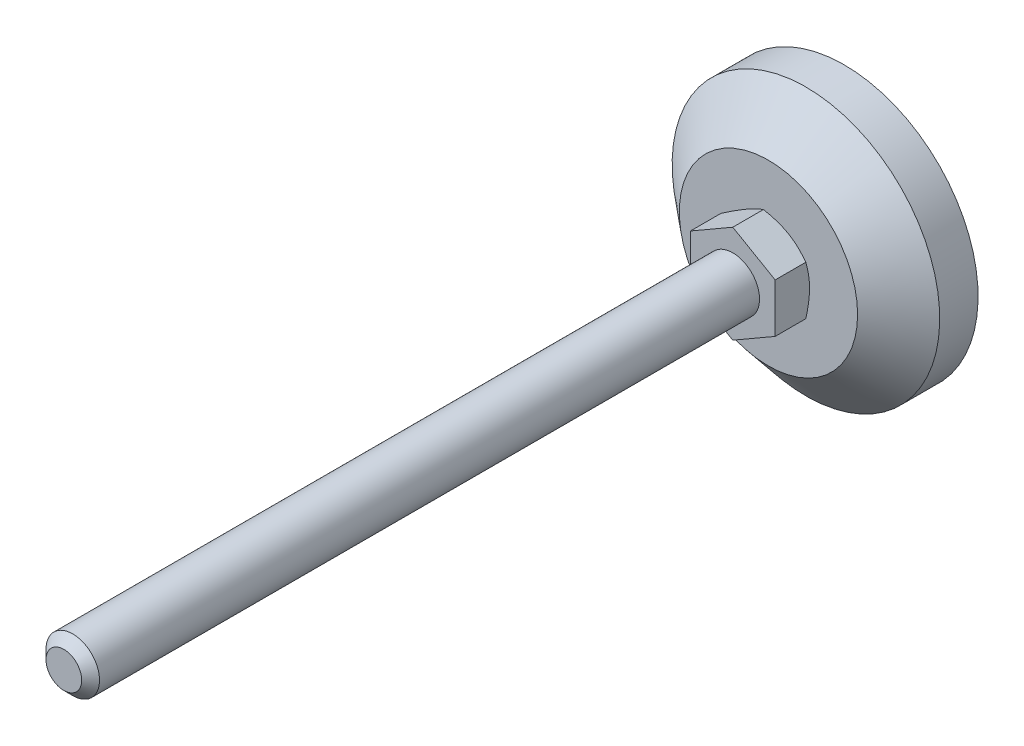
ISO-10303-21;
HEADER;
FILE_DESCRIPTION(('STEP AP214'),'2;1');
FILE_NAME('part.step','',(''),(''),'','','');
FILE_SCHEMA(('AUTOMOTIVE_DESIGN { 1 0 10303 214 1 1 1 1 }'));
ENDSEC;
DATA;
#1=APPLICATION_CONTEXT('core data for automotive mechanical design processes');
#2=APPLICATION_PROTOCOL_DEFINITION('international standard','automotive_design',2000,#1);
#3=PRODUCT_CONTEXT('',#1,'mechanical');
#4=PRODUCT('Part','Part','',(#3));
#5=PRODUCT_RELATED_PRODUCT_CATEGORY('part','',(#4));
#6=PRODUCT_DEFINITION_FORMATION('','',#4);
#7=PRODUCT_DEFINITION_CONTEXT('part definition',#1,'design');
#8=PRODUCT_DEFINITION('design','',#6,#7);
#9=PRODUCT_DEFINITION_SHAPE('','',#8);
#10=(LENGTH_UNIT() NAMED_UNIT(*) SI_UNIT(.MILLI.,.METRE.));
#11=(NAMED_UNIT(*) PLANE_ANGLE_UNIT() SI_UNIT($,.RADIAN.));
#12=(NAMED_UNIT(*) SI_UNIT($,.STERADIAN.) SOLID_ANGLE_UNIT());
#13=UNCERTAINTY_MEASURE_WITH_UNIT(LENGTH_MEASURE(1.E-05),#10,'distance_accuracy_value','');
#14=(GEOMETRIC_REPRESENTATION_CONTEXT(3) GLOBAL_UNCERTAINTY_ASSIGNED_CONTEXT((#13)) GLOBAL_UNIT_ASSIGNED_CONTEXT((#10,
#11,#12)) REPRESENTATION_CONTEXT('',''));
#15=CARTESIAN_POINT('',(0.,0.,0.));
#16=DIRECTION('',(0.,0.,1.));
#17=DIRECTION('',(1.,0.,0.));
#18=AXIS2_PLACEMENT_3D('',#15,#16,#17);
#19=CARTESIAN_POINT('',(0.,0.,25.));
#20=DIRECTION('',(0.,0.,1.));
#21=DIRECTION('',(0.5,-0.866025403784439,0.));
#22=AXIS2_PLACEMENT_3D('',#19,#20,#21);
#23=PLANE('',#22);
#24=DIRECTION('',(0.,1.,0.));
#25=VECTOR('',#24,1.);
#26=CARTESIAN_POINT('',(9.5,-5.48482755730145,25.));
#27=LINE('',#26,#25);
#28=CARTESIAN_POINT('',(9.5,-5.48482755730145,25.));
#29=VERTEX_POINT('',#28);
#30=CARTESIAN_POINT('',(9.5,5.48482755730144,25.));
#31=VERTEX_POINT('',#30);
#32=EDGE_CURVE('E197',#29,#31,#27,.T.);
#33=ORIENTED_EDGE('',*,*,#32,.T.);
#34=DIRECTION('',(-0.866025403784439,0.5,0.));
#35=VECTOR('',#34,1.);
#36=CARTESIAN_POINT('',(9.5,5.48482755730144,25.));
#37=LINE('',#36,#35);
#38=CARTESIAN_POINT('',(0.,10.9696551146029,25.));
#39=VERTEX_POINT('',#38);
#40=EDGE_CURVE('E320',#31,#39,#37,.T.);
#41=ORIENTED_EDGE('',*,*,#40,.T.);
#42=DIRECTION('',(-0.866025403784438,-0.5,0.));
#43=VECTOR('',#42,1.);
#44=CARTESIAN_POINT('',(0.,10.9696551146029,25.));
#45=LINE('',#44,#43);
#46=CARTESIAN_POINT('',(-9.5,5.48482755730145,25.));
#47=VERTEX_POINT('',#46);
#48=EDGE_CURVE('E319',#39,#47,#45,.T.);
#49=ORIENTED_EDGE('',*,*,#48,.T.);
#50=DIRECTION('',(0.,-1.,0.));
#51=VECTOR('',#50,1.);
#52=CARTESIAN_POINT('',(-9.5,5.48482755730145,25.));
#53=LINE('',#52,#51);
#54=CARTESIAN_POINT('',(-9.5,-5.48482755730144,25.));
#55=VERTEX_POINT('',#54);
#56=EDGE_CURVE('E324',#47,#55,#53,.T.);
#57=ORIENTED_EDGE('',*,*,#56,.T.);
#58=DIRECTION('',(0.866025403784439,-0.5,0.));
#59=VECTOR('',#58,1.);
#60=CARTESIAN_POINT('',(-9.5,-5.48482755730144,25.));
#61=LINE('',#60,#59);
#62=CARTESIAN_POINT('',(0.,-10.9696551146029,25.));
#63=VERTEX_POINT('',#62);
#64=EDGE_CURVE('E326',#55,#63,#61,.T.);
#65=ORIENTED_EDGE('',*,*,#64,.T.);
#66=DIRECTION('',(0.866025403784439,0.5,0.));
#67=VECTOR('',#66,1.);
#68=CARTESIAN_POINT('',(0.,-10.9696551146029,25.));
#69=LINE('',#68,#67);
#70=EDGE_CURVE('E37',#63,#29,#69,.T.);
#71=ORIENTED_EDGE('',*,*,#70,.T.);
#72=EDGE_LOOP('',(#33,#41,#49,#57,#65,#71));
#73=FACE_BOUND('',#72,.T.);
#74=CARTESIAN_POINT('',(0.,0.,25.));
#75=DIRECTION('',(0.,0.,1.));
#76=DIRECTION('',(0.5,-0.866025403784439,0.));
#77=AXIS2_PLACEMENT_3D('',#74,#75,#76);
#78=CIRCLE('',#77,6.);
#79=CARTESIAN_POINT('',(3.,-5.19615242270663,25.));
#80=VERTEX_POINT('',#79);
#81=EDGE_CURVE('E201',#80,#80,#78,.T.);
#82=ORIENTED_EDGE('',*,*,#81,.F.);
#83=EDGE_LOOP('',(#82));
#84=FACE_BOUND('',#83,.T.);
#85=ADVANCED_FACE('F14',(#73,#84),#23,.T.);
#86=CARTESIAN_POINT('',(-9.99463491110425,17.3112154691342,17.));
#87=DIRECTION('',(0.,0.,1.));
#88=DIRECTION('',(0.5,-0.866025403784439,0.));
#89=AXIS2_PLACEMENT_3D('',#86,#87,#88);
#90=PLANE('',#89);
#91=CARTESIAN_POINT('',(0.,0.,17.));
#92=DIRECTION('',(0.,0.,-1.));
#93=DIRECTION('',(-0.5,0.866025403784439,0.));
#94=AXIS2_PLACEMENT_3D('',#91,#92,#93);
#95=CIRCLE('',#94,19.9892698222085);
#96=CARTESIAN_POINT('',(-9.99463491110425,17.3112154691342,17.));
#97=VERTEX_POINT('',#96);
#98=EDGE_CURVE('E102',#97,#97,#95,.T.);
#99=ORIENTED_EDGE('',*,*,#98,.F.);
#100=EDGE_LOOP('',(#99));
#101=FACE_BOUND('',#100,.T.);
#102=CARTESIAN_POINT('',(0.,0.,17.));
#103=DIRECTION('',(0.,0.,-1.));
#104=DIRECTION('',(-0.5,0.866025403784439,0.));
#105=AXIS2_PLACEMENT_3D('',#102,#103,#104);
#106=CIRCLE('',#105,9.);
#107=CARTESIAN_POINT('',(-4.5,7.79422863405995,17.));
#108=VERTEX_POINT('',#107);
#109=EDGE_CURVE('E84',#108,#108,#106,.T.);
#110=ORIENTED_EDGE('',*,*,#109,.T.);
#111=EDGE_LOOP('',(#110));
#112=FACE_BOUND('',#111,.T.);
#113=ADVANCED_FACE('F174',(#101,#112),#90,.T.);
#114=CARTESIAN_POINT('',(0.,0.,0.));
#115=DIRECTION('',(0.,0.,-1.));
#116=DIRECTION('',(-0.5,0.866025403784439,0.));
#117=AXIS2_PLACEMENT_3D('',#114,#115,#116);
#118=PLANE('',#117);
#119=CARTESIAN_POINT('',(0.,0.,0.));
#120=DIRECTION('',(0.,0.,-1.));
#121=DIRECTION('',(-0.5,0.866025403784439,0.));
#122=AXIS2_PLACEMENT_3D('',#119,#120,#121);
#123=CIRCLE('',#122,30.);
#124=CARTESIAN_POINT('',(-15.,25.9807621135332,0.));
#125=VERTEX_POINT('',#124);
#126=EDGE_CURVE('E73',#125,#125,#123,.T.);
#127=ORIENTED_EDGE('',*,*,#126,.T.);
#128=EDGE_LOOP('',(#127));
#129=FACE_BOUND('',#128,.T.);
#130=ADVANCED_FACE('F177',(#129),#118,.T.);
#131=CARTESIAN_POINT('',(0.,0.,-75.4972525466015));
#132=DIRECTION('',(0.,0.,-1.));
#133=DIRECTION('',(-0.5,0.866025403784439,0.));
#134=AXIS2_PLACEMENT_3D('',#131,#132,#133);
#135=CYLINDRICAL_SURFACE('',#134,30.);
#136=CARTESIAN_POINT('',(0.,0.,8.6));
#137=DIRECTION('',(0.,0.,-1.));
#138=DIRECTION('',(-0.5,0.866025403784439,0.));
#139=AXIS2_PLACEMENT_3D('',#136,#137,#138);
#140=CIRCLE('',#139,30.);
#141=CARTESIAN_POINT('',(-15.,25.9807621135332,8.6));
#142=VERTEX_POINT('',#141);
#143=EDGE_CURVE('E105',#142,#142,#140,.T.);
#144=ORIENTED_EDGE('',*,*,#143,.T.);
#145=EDGE_LOOP('',(#144));
#146=FACE_BOUND('',#145,.T.);
#147=ORIENTED_EDGE('',*,*,#126,.F.);
#148=EDGE_LOOP('',(#147));
#149=FACE_BOUND('',#148,.T.);
#150=ADVANCED_FACE('F181',(#146,#149),#135,.T.);
#151=CARTESIAN_POINT('',(0.,0.,8.6));
#152=DIRECTION('',(0.,0.,-1.));
#153=DIRECTION('',(-0.5,0.866025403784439,0.));
#154=AXIS2_PLACEMENT_3D('',#151,#152,#153);
#155=CONICAL_SURFACE('',#154,30.,0.872664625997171);
#156=ORIENTED_EDGE('',*,*,#98,.T.);
#157=EDGE_LOOP('',(#156));
#158=FACE_BOUND('',#157,.T.);
#159=ORIENTED_EDGE('',*,*,#143,.F.);
#160=EDGE_LOOP('',(#159));
#161=FACE_BOUND('',#160,.T.);
#162=ADVANCED_FACE('F121',(#158,#161),#155,.T.);
#163=CARTESIAN_POINT('',(0.,0.,20.2070856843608));
#164=DIRECTION('',(0.,0.,1.));
#165=DIRECTION('',(0.5,-0.866025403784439,0.));
#166=AXIS2_PLACEMENT_3D('',#163,#164,#165);
#167=CONICAL_SURFACE('',#166,14.5548353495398,1.0471975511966);
#168=ORIENTED_EDGE('',*,*,#109,.F.);
#169=EDGE_LOOP('',(#168));
#170=FACE_BOUND('',#169,.T.);
#171=CARTESIAN_POINT('',(-8.0629212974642,-15.6247848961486,21.955113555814));
#172=CARTESIAN_POINT('',(-7.88302842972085,-15.5209237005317,21.8541996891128));
#173=CARTESIAN_POINT('',(-7.70292590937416,-15.4169414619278,21.7537843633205));
#174=CARTESIAN_POINT('',(-7.34225784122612,-15.2087096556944,21.5540635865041));
#175=CARTESIAN_POINT('',(-7.16169228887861,-15.1044600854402,21.4547581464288));
#176=CARTESIAN_POINT('',(-6.61918813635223,-14.7912451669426,21.158650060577));
#177=CARTESIAN_POINT('',(-6.25649443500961,-14.5818438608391,20.9636851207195));
#178=CARTESIAN_POINT('',(-5.52674967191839,-14.1605255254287,20.5787866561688));
#179=CARTESIAN_POINT('',(-5.15968567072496,-13.9486010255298,20.3888857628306));
#180=CARTESIAN_POINT('',(-4.42265753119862,-13.5230776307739,20.016769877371));
#181=CARTESIAN_POINT('',(-4.05269352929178,-13.3094788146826,19.834554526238));
#182=CARTESIAN_POINT('',(-3.29714002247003,-12.8732597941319,19.4740509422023));
#183=CARTESIAN_POINT('',(-2.911434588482,-12.650572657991,19.2960849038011));
#184=CARTESIAN_POINT('',(-2.1355321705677,-12.2026051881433,18.953471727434));
#185=CARTESIAN_POINT('',(-1.74533469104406,-11.9773245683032,18.7888260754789));
#186=CARTESIAN_POINT('',(-0.960535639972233,-11.5242206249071,18.4771310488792));
#187=CARTESIAN_POINT('',(-0.565944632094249,-11.2964034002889,18.3300465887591));
#188=CARTESIAN_POINT('',(0.228883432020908,-10.8375092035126,18.0581506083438));
#189=CARTESIAN_POINT('',(0.62911868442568,-10.6064332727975,17.9333321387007));
#190=CARTESIAN_POINT('',(1.43330236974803,-10.1421376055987,17.7125905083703));
#191=CARTESIAN_POINT('',(1.83721725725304,-9.90893723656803,17.6165087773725));
#192=CARTESIAN_POINT('',(2.44681047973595,-9.55698842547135,17.4980679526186));
#193=CARTESIAN_POINT('',(2.65064289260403,-9.4393057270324,17.4628663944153));
#194=CARTESIAN_POINT('',(3.05933909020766,-9.20334486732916,17.4017128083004));
#195=CARTESIAN_POINT('',(3.26420277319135,-9.08506676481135,17.3757598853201));
#196=CARTESIAN_POINT('',(3.67198665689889,-8.84963262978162,17.3339494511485));
#197=CARTESIAN_POINT('',(3.87489694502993,-8.73248232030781,17.3179635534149));
#198=CARTESIAN_POINT('',(4.28112129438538,-8.49794858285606,17.2959174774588));
#199=CARTESIAN_POINT('',(4.48443534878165,-8.38056515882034,17.2898571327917));
#200=CARTESIAN_POINT('',(4.89110353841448,-8.14577517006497,17.2878069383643));
#201=CARTESIAN_POINT('',(5.09445767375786,-8.02836860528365,17.2918171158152));
#202=CARTESIAN_POINT('',(5.50083733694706,-7.79374519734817,17.3098091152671));
#203=CARTESIAN_POINT('',(5.70386284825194,-7.67652836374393,17.3237914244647));
#204=CARTESIAN_POINT('',(6.19015483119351,-7.39576755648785,17.3689276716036));
#205=CARTESIAN_POINT('',(6.47310620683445,-7.23240550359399,17.4047077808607));
#206=CARTESIAN_POINT('',(7.03693098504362,-6.90688111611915,17.4936993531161));
#207=CARTESIAN_POINT('',(7.31780410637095,-6.74471894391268,17.546913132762));
#208=CARTESIAN_POINT('',(8.15697152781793,-6.2602254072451,17.729885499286));
#209=CARTESIAN_POINT('',(8.71150741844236,-5.94006396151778,17.8829428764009));
#210=CARTESIAN_POINT('',(9.54078576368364,-5.4612798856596,18.148698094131));
#211=CARTESIAN_POINT('',(9.819821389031,-5.30017859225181,18.2445639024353));
#212=CARTESIAN_POINT('',(10.375183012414,-4.97954040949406,18.4463370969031));
#213=CARTESIAN_POINT('',(10.6515089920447,-4.82000353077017,18.552244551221));
#214=CARTESIAN_POINT('',(11.201537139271,-4.50244463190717,18.7723946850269));
#215=CARTESIAN_POINT('',(11.4752401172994,-4.34442214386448,18.8866346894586));
#216=CARTESIAN_POINT('',(12.0203730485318,-4.02968949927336,19.1220972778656));
#217=CARTESIAN_POINT('',(12.2918030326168,-3.87297932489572,19.2433197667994));
#218=CARTESIAN_POINT('',(12.9489666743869,-3.4935657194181,19.544986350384));
#219=CARTESIAN_POINT('',(13.3336498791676,-3.27146876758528,19.7284765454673));
#220=CARTESIAN_POINT('',(14.0996081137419,-2.82924257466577,20.104736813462));
#221=CARTESIAN_POINT('',(14.4808829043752,-2.60911347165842,20.2975075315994));
#222=CARTESIAN_POINT('',(15.2406869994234,-2.170440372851,20.6904048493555));
#223=CARTESIAN_POINT('',(15.619215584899,-1.95189679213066,20.8905332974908));
#224=CARTESIAN_POINT('',(16.3739075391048,-1.51617518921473,21.2966079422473));
#225=CARTESIAN_POINT('',(16.7500709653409,-1.29899713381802,21.5025539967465));
#226=CARTESIAN_POINT('',(17.5008876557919,-0.865512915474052,21.9193891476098));
#227=CARTESIAN_POINT('',(17.8755385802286,-0.649208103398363,22.1302838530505));
#228=CARTESIAN_POINT('',(18.6232021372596,-0.217544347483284,22.5559100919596));
#229=CARTESIAN_POINT('',(18.9962147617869,-0.00218540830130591,22.7706416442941));
#230=CARTESIAN_POINT('',(19.7408074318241,0.42770537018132,23.203233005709));
#231=CARTESIAN_POINT('',(20.112387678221,0.642237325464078,23.4210923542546));
#232=CARTESIAN_POINT('',(20.8543824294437,1.07062819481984,23.8594435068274));
#233=CARTESIAN_POINT('',(21.2247969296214,1.28448710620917,24.0799353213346));
#234=CARTESIAN_POINT('',(22.2694002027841,1.88758908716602,24.7056802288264));
#235=CARTESIAN_POINT('',(22.9424390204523,2.2761682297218,25.1134927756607));
#236=CARTESIAN_POINT('',(24.2860532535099,3.05190426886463,25.9345548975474));
#237=CARTESIAN_POINT('',(24.9566285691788,3.439061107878,26.3478046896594));
#238=CARTESIAN_POINT('',(26.2940646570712,4.21123019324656,27.1773352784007));
#239=CARTESIAN_POINT('',(26.9609305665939,4.59624540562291,27.5936050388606));
#240=CARTESIAN_POINT('',(27.9600759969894,5.17310228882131,28.2204041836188));
#241=CARTESIAN_POINT('',(28.2929225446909,5.3652713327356,28.4297301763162));
#242=CARTESIAN_POINT('',(28.958275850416,5.74941324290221,28.8490996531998));
#243=CARTESIAN_POINT('',(29.2907826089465,5.94138610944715,29.0591431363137));
#244=CARTESIAN_POINT('',(29.6231390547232,6.13327219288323,29.269503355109));
#245=B_SPLINE_CURVE_WITH_KNOTS('',3,(#171,#172,#173,#174,#175,#176,#177,#178,#179,#180,#181,
#182,#183,#184,#185,#186,#187,#188,#189,#190,#191,#192,#193,#194,#195,#196,#197,#198,#199,#200,
#201,#202,#203,#204,#205,#206,#207,#208,#209,#210,#211,#212,#213,#214,#215,#216,#217,#218,#219,
#220,#221,#222,#223,#224,#225,#226,#227,#228,#229,#230,#231,#232,#233,#234,#235,#236,#237,#238,
#239,#240,#241,#242,#243,#244),.UNSPECIFIED.,.F.,.F.,(4,2,2,2,2,2,2,2,2,2,2,2,2,2,2,2,2,2,2,2,2,
2,2,2,2,2,2,2,2,2,2,2,2,2,2,2,4),(0.,0.692811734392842,1.38563029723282,2.7714693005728,
4.16474840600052,5.55796235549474,6.99664082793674,8.43547957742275,9.87139378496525,
11.3068590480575,12.734250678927,13.4480473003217,14.1617748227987,14.8661077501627,
15.5704288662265,16.2747518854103,16.9791093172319,17.9645860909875,18.9501938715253,
20.9224706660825,21.9308705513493,22.9392772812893,23.9473616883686,24.9554323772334,
26.397088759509,27.838845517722,29.2809670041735,30.7230532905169,32.1668616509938,
33.6106771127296,35.0542821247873,36.4978928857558,39.1308383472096,41.7638892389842,
44.3899112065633,45.7028456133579,47.0157780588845),.UNSPECIFIED.);
#246=CARTESIAN_POINT('',(0.,-10.9696551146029,18.1371809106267));
#247=VERTEX_POINT('',#246);
#248=CARTESIAN_POINT('',(9.5,-5.48482755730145,18.1371809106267));
#249=VERTEX_POINT('',#248);
#250=EDGE_CURVE('E65',#247,#249,#245,.T.);
#251=ORIENTED_EDGE('',*,*,#250,.F.);
#252=CARTESIAN_POINT('',(-9.5002,-5.4847120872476,18.137247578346));
#253=CARTESIAN_POINT('',(-9.29136922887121,-5.60528058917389,18.0676485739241));
#254=CARTESIAN_POINT('',(-9.0817598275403,-5.72629863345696,18.0012084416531));
#255=CARTESIAN_POINT('',(-8.66086011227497,-5.96930519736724,17.8755224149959));
#256=CARTESIAN_POINT('',(-8.44956926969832,-6.09129402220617,17.8162788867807));
#257=CARTESIAN_POINT('',(-7.81229220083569,-6.45922610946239,17.6504897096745));
#258=CARTESIAN_POINT('',(-7.38379023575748,-6.70662183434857,17.5561895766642));
#259=CARTESIAN_POINT('',(-6.74255666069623,-7.07683821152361,17.4456138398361));
#260=CARTESIAN_POINT('',(-6.53174078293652,-7.19855281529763,17.4141149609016));
#261=CARTESIAN_POINT('',(-6.10913296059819,-7.4425455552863,17.3612933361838));
#262=CARTESIAN_POINT('',(-5.89734099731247,-7.56482370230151,17.3399707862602));
#263=CARTESIAN_POINT('',(-5.47340378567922,-7.80958396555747,17.3080481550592));
#264=CARTESIAN_POINT('',(-5.26125925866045,-7.93206566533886,17.2974353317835));
#265=CARTESIAN_POINT('',(-4.83677424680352,-8.17714220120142,17.2871576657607));
#266=CARTESIAN_POINT('',(-4.62443376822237,-8.29973703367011,17.2874924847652));
#267=CARTESIAN_POINT('',(-4.22745800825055,-8.5289310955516,17.2983485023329));
#268=CARTESIAN_POINT('',(-4.04279470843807,-8.63554650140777,17.3075454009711));
#269=CARTESIAN_POINT('',(-3.67389999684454,-8.84852796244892,17.3340405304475));
#270=CARTESIAN_POINT('',(-3.48966861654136,-8.95489399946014,17.3513393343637));
#271=CARTESIAN_POINT('',(-2.937688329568,-9.27357996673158,17.414979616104));
#272=CARTESIAN_POINT('',(-2.57091646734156,-9.48533580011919,17.4730570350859));
#273=CARTESIAN_POINT('',(-1.83348217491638,-9.91109368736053,17.618251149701));
#274=CARTESIAN_POINT('',(-1.46291385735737,-10.1250414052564,17.7059833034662));
#275=CARTESIAN_POINT('',(-0.727303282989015,-10.5497463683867,17.9050988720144));
#276=CARTESIAN_POINT('',(-0.362251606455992,-10.7605090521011,18.0164355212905));
#277=CARTESIAN_POINT('',(0.000200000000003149,-10.9697705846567,18.137247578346));
#278=B_SPLINE_CURVE_WITH_KNOTS('',3,(#252,#253,#254,#255,#256,#257,#258,#259,#260,#261,#262,
#263,#264,#265,#266,#267,#268,#269,#270,#271,#272,#273,#274,#275,#276,#277),.UNSPECIFIED.,.F.,
.F.,(4,2,2,2,2,2,2,2,2,2,2,2,4),(0.,0.752880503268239,1.50600787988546,3.0154687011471,
3.75167336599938,4.48789219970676,5.22323407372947,5.95855322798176,6.59868084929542,
7.23885375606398,8.52010929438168,9.82978009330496,11.1368800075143),.UNSPECIFIED.);
#279=CARTESIAN_POINT('',(-9.5,-5.48482755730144,18.1371809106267));
#280=VERTEX_POINT('',#279);
#281=EDGE_CURVE('E68',#280,#247,#278,.T.);
#282=ORIENTED_EDGE('',*,*,#281,.F.);
#283=CARTESIAN_POINT('',(-9.5,5.48505849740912,18.137247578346));
#284=CARTESIAN_POINT('',(-9.5,5.24392149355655,18.0676485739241));
#285=CARTESIAN_POINT('',(-9.5,5.0018854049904,18.0012084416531));
#286=CARTESIAN_POINT('',(-9.5,4.51587227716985,17.8755224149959));
#287=CARTESIAN_POINT('',(-9.5,4.27189462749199,17.8162788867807));
#288=CARTESIAN_POINT('',(-9.5,3.53603045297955,17.6504897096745));
#289=CARTESIAN_POINT('',(-9.5,3.04123900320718,17.5561895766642));
#290=CARTESIAN_POINT('',(-9.5,2.3008062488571,17.4456138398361));
#291=CARTESIAN_POINT('',(-9.5,2.05737704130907,17.4141149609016));
#292=CARTESIAN_POINT('',(-9.5,1.56939156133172,17.3612933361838));
#293=CARTESIAN_POINT('',(-9.5,1.32483526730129,17.3399707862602));
#294=CARTESIAN_POINT('',(-9.5,0.835314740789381,17.3080481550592));
#295=CARTESIAN_POINT('',(-9.5,0.590351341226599,17.2974353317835));
#296=CARTESIAN_POINT('',(-9.5,0.100198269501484,17.2871576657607));
#297=CARTESIAN_POINT('',(-9.5,-0.144991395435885,17.2874924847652));
#298=CARTESIAN_POINT('',(-9.5,-0.603379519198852,17.2983485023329));
#299=CARTESIAN_POINT('',(-9.5,-0.816610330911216,17.3075454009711));
#300=CARTESIAN_POINT('',(-9.5,-1.24257325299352,17.3340405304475));
#301=CARTESIAN_POINT('',(-9.5,-1.45530532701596,17.3513393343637));
#302=CARTESIAN_POINT('',(-9.5,-2.09267726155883,17.414979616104));
#303=CARTESIAN_POINT('',(-9.5,-2.51618892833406,17.4730570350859));
#304=CARTESIAN_POINT('',(-9.5,-3.36770470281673,17.618251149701));
#305=CARTESIAN_POINT('',(-9.5,-3.79560013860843,17.7059833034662));
#306=CARTESIAN_POINT('',(-9.5,-4.64501006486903,17.9050988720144));
#307=CARTESIAN_POINT('',(-9.5,-5.06653543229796,18.0164355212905));
#308=CARTESIAN_POINT('',(-9.5,-5.48505849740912,18.137247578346));
#309=B_SPLINE_CURVE_WITH_KNOTS('',3,(#283,#284,#285,#286,#287,#288,#289,#290,#291,#292,#293,
#294,#295,#296,#297,#298,#299,#300,#301,#302,#303,#304,#305,#306,#307,#308),.UNSPECIFIED.,.F.,
.F.,(4,2,2,2,2,2,2,2,2,2,2,2,4),(0.,0.752880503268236,1.50600787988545,3.0154687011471,
3.75167336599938,4.48789219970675,5.22323407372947,5.95855322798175,6.59868084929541,
7.23885375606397,8.52010929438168,9.82978009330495,11.1368800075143),.UNSPECIFIED.);
#310=CARTESIAN_POINT('',(-9.5,5.48482755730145,18.1371809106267));
#311=VERTEX_POINT('',#310);
#312=EDGE_CURVE('E83',#311,#280,#309,.T.);
#313=ORIENTED_EDGE('',*,*,#312,.F.);
#314=CARTESIAN_POINT('',(-17.5629212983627,0.829697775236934,21.9551135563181));
#315=CARTESIAN_POINT('',(-17.3830284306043,0.933558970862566,21.8541996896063));
#316=CARTESIAN_POINT('',(-17.2029259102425,1.03754120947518,21.7537843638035));
#317=CARTESIAN_POINT('',(-16.8422578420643,1.245773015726,21.5540635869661));
#318=CARTESIAN_POINT('',(-16.6616922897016,1.35002258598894,21.4547581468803));
#319=CARTESIAN_POINT('',(-16.1191881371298,1.66323750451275,21.1586500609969));
#320=CARTESIAN_POINT('',(-15.7564944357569,1.8726388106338,20.9636851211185));
#321=CARTESIAN_POINT('',(-15.0267496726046,2.29395714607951,20.5787866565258));
#322=CARTESIAN_POINT('',(-14.6596856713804,2.50588164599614,20.3888857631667));
#323=CARTESIAN_POINT('',(-13.9226575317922,2.93140504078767,20.0167698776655));
#324=CARTESIAN_POINT('',(-13.5526935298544,3.14500385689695,19.8345545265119));
#325=CARTESIAN_POINT('',(-12.7971400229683,3.58122287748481,19.4740509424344));
#326=CARTESIAN_POINT('',(-12.4114345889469,3.80391001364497,19.296084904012));
#327=CARTESIAN_POINT('',(-11.6355321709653,4.25187748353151,18.9534717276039));
#328=CARTESIAN_POINT('',(-11.2453346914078,4.47715810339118,18.7888260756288));
#329=CARTESIAN_POINT('',(-10.4605356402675,4.93026204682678,18.477131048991));
#330=CARTESIAN_POINT('',(-10.065944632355,5.15807927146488,18.3300465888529));
#331=CARTESIAN_POINT('',(-9.27111656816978,5.61697346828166,18.0581506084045));
#332=CARTESIAN_POINT('',(-8.87088131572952,5.84804939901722,17.9333321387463));
#333=CARTESIAN_POINT('',(-8.06669763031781,6.31234506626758,17.7125905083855));
#334=CARTESIAN_POINT('',(-7.66278274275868,6.54554543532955,17.6165087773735));
#335=CARTESIAN_POINT('',(-7.05318952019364,6.89749424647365,17.4980679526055));
#336=CARTESIAN_POINT('',(-6.84935710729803,7.0151769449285,17.4628663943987));
#337=CARTESIAN_POINT('',(-6.44066090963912,7.25113780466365,17.4017128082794));
#338=CARTESIAN_POINT('',(-6.23579722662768,7.36941590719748,17.3757598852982));
#339=CARTESIAN_POINT('',(-5.82801334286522,7.60485004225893,17.3339494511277));
#340=CARTESIAN_POINT('',(-5.62510305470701,7.72200035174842,17.3179635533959));
#341=CARTESIAN_POINT('',(-5.21887870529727,7.95653408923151,17.2959174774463));
#342=CARTESIAN_POINT('',(-5.01556465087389,8.07391751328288,17.2898571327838));
#343=CARTESIAN_POINT('',(-4.60889646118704,8.30870750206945,17.2878069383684));
#344=CARTESIAN_POINT('',(-4.40554232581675,8.42611406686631,17.2918171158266));
#345=CARTESIAN_POINT('',(-3.9991626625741,8.66073747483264,17.3098091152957));
#346=CARTESIAN_POINT('',(-3.79613715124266,8.7779543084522,17.3237914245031));
#347=CARTESIAN_POINT('',(-3.30984516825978,9.05871511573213,17.3689276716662));
#348=CARTESIAN_POINT('',(-3.0268937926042,9.22207716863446,17.4047077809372));
#349=CARTESIAN_POINT('',(-2.46306901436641,9.54760155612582,17.4936993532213));
#350=CARTESIAN_POINT('',(-2.18219589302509,9.70976372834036,17.5469131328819));
#351=CARTESIAN_POINT('',(-1.34302847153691,10.1942572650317,17.7298854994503));
#352=CARTESIAN_POINT('',(-0.788492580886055,10.5144187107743,17.8829428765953));
#353=CARTESIAN_POINT('',(0.0407857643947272,10.9932027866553,18.1486980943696));
#354=CARTESIAN_POINT('',(0.319821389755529,11.1543040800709,18.2445639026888));
#355=CARTESIAN_POINT('',(0.875183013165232,11.474942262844,18.4463370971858));
#356=CARTESIAN_POINT('',(1.15150899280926,11.6344791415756,18.5522445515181));
#357=CARTESIAN_POINT('',(1.70153714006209,11.9520380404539,18.7723946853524));
#358=CARTESIAN_POINT('',(1.97524011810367,12.1100605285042,18.886634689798));
#359=CARTESIAN_POINT('',(2.52037304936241,12.4247931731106,19.1220972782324));
#360=CARTESIAN_POINT('',(2.79180303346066,12.5815033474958,19.2433197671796));
#361=CARTESIAN_POINT('',(3.44896667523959,12.9609169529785,19.5449863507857));
#362=CARTESIAN_POINT('',(3.8336498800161,13.183013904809,19.728476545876));
#363=CARTESIAN_POINT('',(4.5996081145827,13.625240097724,20.1047368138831));
#364=CARTESIAN_POINT('',(4.98088290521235,13.8453692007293,20.2975075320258));
#365=CARTESIAN_POINT('',(5.74068700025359,14.2840422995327,20.6904048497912));
#366=CARTESIAN_POINT('',(6.11921558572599,14.5025858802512,20.8905332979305));
#367=CARTESIAN_POINT('',(6.87390753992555,14.9383074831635,21.2966079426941));
#368=CARTESIAN_POINT('',(7.25007096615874,15.1554855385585,21.5025539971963));
#369=CARTESIAN_POINT('',(8.00088765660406,15.5889697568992,21.9193891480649));
#370=CARTESIAN_POINT('',(8.37553858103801,15.8052745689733,22.1302838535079));
#371=CARTESIAN_POINT('',(9.12320213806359,16.2369383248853,22.5559100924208));
#372=CARTESIAN_POINT('',(9.49621476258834,16.4522972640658,22.7706416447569));
#373=CARTESIAN_POINT('',(10.2408074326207,16.8821880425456,23.2032330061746));
#374=CARTESIAN_POINT('',(10.6123876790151,17.0967199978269,23.4210923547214));
#375=CARTESIAN_POINT('',(11.3543824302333,17.5251108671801,23.8594435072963));
#376=CARTESIAN_POINT('',(11.7247969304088,17.7389697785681,24.0799353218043));
#377=CARTESIAN_POINT('',(12.7694002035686,18.3420717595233,24.7056802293));
#378=CARTESIAN_POINT('',(13.4424390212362,18.7306509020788,25.113492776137));
#379=CARTESIAN_POINT('',(14.786053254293,19.5063869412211,25.9345548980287));
#380=CARTESIAN_POINT('',(15.4566285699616,19.8935437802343,26.3478046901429));
#381=CARTESIAN_POINT('',(16.7940646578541,20.665712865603,27.1773352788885));
#382=CARTESIAN_POINT('',(17.4609305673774,21.0507280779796,27.5936050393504));
#383=CARTESIAN_POINT('',(18.4600759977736,21.6275849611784,28.2204041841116));
#384=CARTESIAN_POINT('',(18.7929225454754,21.8197540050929,28.42973017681));
#385=CARTESIAN_POINT('',(19.4582758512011,22.2038959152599,28.8490996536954));
#386=CARTESIAN_POINT('',(19.7907826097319,22.395868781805,29.0591431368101));
#387=CARTESIAN_POINT('',(20.1231390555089,22.5877548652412,29.2695033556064));
#388=B_SPLINE_CURVE_WITH_KNOTS('',3,(#314,#315,#316,#317,#318,#319,#320,#321,#322,#323,#324,
#325,#326,#327,#328,#329,#330,#331,#332,#333,#334,#335,#336,#337,#338,#339,#340,#341,#342,#343,
#344,#345,#346,#347,#348,#349,#350,#351,#352,#353,#354,#355,#356,#357,#358,#359,#360,#361,#362,
#363,#364,#365,#366,#367,#368,#369,#370,#371,#372,#373,#374,#375,#376,#377,#378,#379,#380,#381,
#382,#383,#384,#385,#386,#387),.UNSPECIFIED.,.F.,.F.,(4,2,2,2,2,2,2,2,2,2,2,2,2,2,2,2,2,2,2,2,2,
2,2,2,2,2,2,2,2,2,2,2,2,2,2,2,4),(0.,0.692811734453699,1.38563029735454,2.77146930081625,
4.16474840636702,5.55796235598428,6.99664082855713,8.43547957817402,9.87139378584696,
11.3068590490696,12.7342506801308,13.4480473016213,14.1617748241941,14.8661077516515,
15.5704288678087,16.2747518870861,16.9791093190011,17.9645860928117,18.9501938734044,
20.9224706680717,21.9308705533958,22.9392772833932,23.9473616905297,24.9554323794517,
26.3970887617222,27.8388455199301,29.2809670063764,30.7230532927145,32.1668616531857,
33.6106771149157,35.0542821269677,36.4978928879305,39.1308383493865,41.7638892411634,
44.3899112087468,45.7028456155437,47.0157780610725),.UNSPECIFIED.);
#389=CARTESIAN_POINT('',(0.,10.9696551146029,18.1371809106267));
#390=VERTEX_POINT('',#389);
#391=EDGE_CURVE('E143',#390,#311,#388,.F.);
#392=ORIENTED_EDGE('',*,*,#391,.F.);
#393=CARTESIAN_POINT('',(9.5002,5.4847120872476,18.137247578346));
#394=CARTESIAN_POINT('',(9.29136922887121,5.60528058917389,18.0676485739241));
#395=CARTESIAN_POINT('',(9.0817598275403,5.72629863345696,18.0012084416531));
#396=CARTESIAN_POINT('',(8.66086011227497,5.96930519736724,17.8755224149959));
#397=CARTESIAN_POINT('',(8.44956926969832,6.09129402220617,17.8162788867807));
#398=CARTESIAN_POINT('',(7.81229220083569,6.45922610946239,17.6504897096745));
#399=CARTESIAN_POINT('',(7.38379023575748,6.70662183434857,17.5561895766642));
#400=CARTESIAN_POINT('',(6.74255666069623,7.07683821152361,17.4456138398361));
#401=CARTESIAN_POINT('',(6.53174078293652,7.19855281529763,17.4141149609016));
#402=CARTESIAN_POINT('',(6.10913296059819,7.4425455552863,17.3612933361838));
#403=CARTESIAN_POINT('',(5.89734099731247,7.56482370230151,17.3399707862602));
#404=CARTESIAN_POINT('',(5.47340378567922,7.80958396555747,17.3080481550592));
#405=CARTESIAN_POINT('',(5.26125925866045,7.93206566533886,17.2974353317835));
#406=CARTESIAN_POINT('',(4.83677424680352,8.17714220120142,17.2871576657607));
#407=CARTESIAN_POINT('',(4.62443376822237,8.29973703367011,17.2874924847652));
#408=CARTESIAN_POINT('',(4.22745800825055,8.5289310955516,17.2983485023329));
#409=CARTESIAN_POINT('',(4.04279470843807,8.63554650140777,17.3075454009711));
#410=CARTESIAN_POINT('',(3.67389999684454,8.84852796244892,17.3340405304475));
#411=CARTESIAN_POINT('',(3.48966861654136,8.95489399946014,17.3513393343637));
#412=CARTESIAN_POINT('',(2.937688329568,9.27357996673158,17.414979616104));
#413=CARTESIAN_POINT('',(2.57091646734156,9.48533580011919,17.4730570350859));
#414=CARTESIAN_POINT('',(1.83348217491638,9.91109368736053,17.618251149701));
#415=CARTESIAN_POINT('',(1.46291385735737,10.1250414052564,17.7059833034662));
#416=CARTESIAN_POINT('',(0.727303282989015,10.5497463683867,17.9050988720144));
#417=CARTESIAN_POINT('',(0.362251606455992,10.7605090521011,18.0164355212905));
#418=CARTESIAN_POINT('',(-0.000200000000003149,10.9697705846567,18.137247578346));
#419=B_SPLINE_CURVE_WITH_KNOTS('',3,(#393,#394,#395,#396,#397,#398,#399,#400,#401,#402,#403,
#404,#405,#406,#407,#408,#409,#410,#411,#412,#413,#414,#415,#416,#417,#418),.UNSPECIFIED.,.F.,
.F.,(4,2,2,2,2,2,2,2,2,2,2,2,4),(0.,0.752880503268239,1.50600787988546,3.0154687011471,
3.75167336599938,4.48789219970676,5.22323407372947,5.95855322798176,6.59868084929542,
7.23885375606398,8.52010929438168,9.82978009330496,11.1368800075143),.UNSPECIFIED.);
#420=CARTESIAN_POINT('',(9.5,5.48482755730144,18.1371809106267));
#421=VERTEX_POINT('',#420);
#422=EDGE_CURVE('E150',#421,#390,#419,.T.);
#423=ORIENTED_EDGE('',*,*,#422,.F.);
#424=CARTESIAN_POINT('',(9.5,-5.48505849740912,18.137247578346));
#425=CARTESIAN_POINT('',(9.5,-5.24392149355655,18.0676485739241));
#426=CARTESIAN_POINT('',(9.5,-5.00188540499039,18.0012084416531));
#427=CARTESIAN_POINT('',(9.5,-4.51587227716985,17.8755224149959));
#428=CARTESIAN_POINT('',(9.5,-4.27189462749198,17.8162788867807));
#429=CARTESIAN_POINT('',(9.5,-3.53603045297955,17.6504897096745));
#430=CARTESIAN_POINT('',(9.5,-3.04123900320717,17.5561895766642));
#431=CARTESIAN_POINT('',(9.5,-2.3008062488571,17.4456138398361));
#432=CARTESIAN_POINT('',(9.5,-2.05737704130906,17.4141149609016));
#433=CARTESIAN_POINT('',(9.5,-1.56939156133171,17.3612933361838));
#434=CARTESIAN_POINT('',(9.5,-1.32483526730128,17.3399707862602));
#435=CARTESIAN_POINT('',(9.5,-0.83531474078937,17.3080481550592));
#436=CARTESIAN_POINT('',(9.5,-0.590351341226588,17.2974353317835));
#437=CARTESIAN_POINT('',(9.5,-0.100198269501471,17.2871576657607));
#438=CARTESIAN_POINT('',(9.5,0.144991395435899,17.2874924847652));
#439=CARTESIAN_POINT('',(9.5,0.603379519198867,17.2983485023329));
#440=CARTESIAN_POINT('',(9.5,0.816610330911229,17.3075454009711));
#441=CARTESIAN_POINT('',(9.5,1.24257325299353,17.3340405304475));
#442=CARTESIAN_POINT('',(9.5,1.45530532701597,17.3513393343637));
#443=CARTESIAN_POINT('',(9.5,2.09267726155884,17.414979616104));
#444=CARTESIAN_POINT('',(9.5,2.51618892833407,17.4730570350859));
#445=CARTESIAN_POINT('',(9.5,3.36770470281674,17.618251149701));
#446=CARTESIAN_POINT('',(9.5,3.79560013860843,17.7059833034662));
#447=CARTESIAN_POINT('',(9.5,4.64501006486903,17.9050988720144));
#448=CARTESIAN_POINT('',(9.5,5.06653543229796,18.0164355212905));
#449=CARTESIAN_POINT('',(9.5,5.48505849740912,18.137247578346));
#450=B_SPLINE_CURVE_WITH_KNOTS('',3,(#424,#425,#426,#427,#428,#429,#430,#431,#432,#433,#434,
#435,#436,#437,#438,#439,#440,#441,#442,#443,#444,#445,#446,#447,#448,#449),.UNSPECIFIED.,.F.,
.F.,(4,2,2,2,2,2,2,2,2,2,2,2,4),(0.,0.75288050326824,1.50600787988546,3.01546870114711,
3.75167336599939,4.48789219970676,5.22323407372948,5.95855322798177,6.59868084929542,
7.23885375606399,8.52010929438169,9.82978009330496,11.1368800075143),.UNSPECIFIED.);
#451=EDGE_CURVE('E29',#249,#421,#450,.T.);
#452=ORIENTED_EDGE('',*,*,#451,.F.);
#453=EDGE_LOOP('',(#251,#282,#313,#392,#423,#452));
#454=FACE_BOUND('',#453,.T.);
#455=ADVANCED_FACE('F67',(#170,#454),#167,.T.);
#456=CARTESIAN_POINT('',(0.,-10.9696551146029,25.));
#457=DIRECTION('',(-0.5,0.866025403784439,0.));
#458=DIRECTION('',(0.,0.,1.));
#459=AXIS2_PLACEMENT_3D('',#456,#457,#458);
#460=PLANE('',#459);
#461=DIRECTION('',(0.,0.,-1.));
#462=VECTOR('',#461,1.);
#463=CARTESIAN_POINT('',(0.,-10.9696551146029,25.));
#464=LINE('',#463,#462);
#465=EDGE_CURVE('E80',#63,#247,#464,.T.);
#466=ORIENTED_EDGE('',*,*,#465,.T.);
#467=ORIENTED_EDGE('',*,*,#250,.T.);
#468=DIRECTION('',(0.,0.,-1.));
#469=VECTOR('',#468,1.);
#470=CARTESIAN_POINT('',(9.5,-5.48482755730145,25.));
#471=LINE('',#470,#469);
#472=EDGE_CURVE('E87',#29,#249,#471,.T.);
#473=ORIENTED_EDGE('',*,*,#472,.F.);
#474=ORIENTED_EDGE('',*,*,#70,.F.);
#475=EDGE_LOOP('',(#466,#467,#473,#474));
#476=FACE_BOUND('',#475,.T.);
#477=ADVANCED_FACE('F86',(#476),#460,.F.);
#478=CARTESIAN_POINT('',(-9.5,-5.48482755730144,25.));
#479=DIRECTION('',(0.5,0.866025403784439,0.));
#480=DIRECTION('',(-0.866025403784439,0.5,0.));
#481=AXIS2_PLACEMENT_3D('',#478,#479,#480);
#482=PLANE('',#481);
#483=DIRECTION('',(0.,0.,-1.));
#484=VECTOR('',#483,1.);
#485=CARTESIAN_POINT('',(-9.5,-5.48482755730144,25.));
#486=LINE('',#485,#484);
#487=EDGE_CURVE('E82',#55,#280,#486,.T.);
#488=ORIENTED_EDGE('',*,*,#487,.T.);
#489=ORIENTED_EDGE('',*,*,#281,.T.);
#490=ORIENTED_EDGE('',*,*,#465,.F.);
#491=ORIENTED_EDGE('',*,*,#64,.F.);
#492=EDGE_LOOP('',(#488,#489,#490,#491));
#493=FACE_BOUND('',#492,.T.);
#494=ADVANCED_FACE('F78',(#493),#482,.F.);
#495=CARTESIAN_POINT('',(-9.5,5.48482755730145,25.));
#496=DIRECTION('',(1.,0.,0.));
#497=DIRECTION('',(0.,1.,0.));
#498=AXIS2_PLACEMENT_3D('',#495,#496,#497);
#499=PLANE('',#498);
#500=DIRECTION('',(0.,0.,-1.));
#501=VECTOR('',#500,1.);
#502=CARTESIAN_POINT('',(-9.5,5.48482755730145,25.));
#503=LINE('',#502,#501);
#504=EDGE_CURVE('E89',#47,#311,#503,.T.);
#505=ORIENTED_EDGE('',*,*,#504,.T.);
#506=ORIENTED_EDGE('',*,*,#312,.T.);
#507=ORIENTED_EDGE('',*,*,#487,.F.);
#508=ORIENTED_EDGE('',*,*,#56,.F.);
#509=EDGE_LOOP('',(#505,#506,#507,#508));
#510=FACE_BOUND('',#509,.T.);
#511=ADVANCED_FACE('F297',(#510),#499,.F.);
#512=CARTESIAN_POINT('',(0.,10.9696551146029,25.));
#513=DIRECTION('',(0.5,-0.866025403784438,0.));
#514=DIRECTION('',(0.866025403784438,0.5,0.));
#515=AXIS2_PLACEMENT_3D('',#512,#513,#514);
#516=PLANE('',#515);
#517=DIRECTION('',(0.,0.,-1.));
#518=VECTOR('',#517,1.);
#519=CARTESIAN_POINT('',(0.,10.9696551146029,25.));
#520=LINE('',#519,#518);
#521=EDGE_CURVE('E96',#39,#390,#520,.T.);
#522=ORIENTED_EDGE('',*,*,#521,.T.);
#523=ORIENTED_EDGE('',*,*,#391,.T.);
#524=ORIENTED_EDGE('',*,*,#504,.F.);
#525=ORIENTED_EDGE('',*,*,#48,.F.);
#526=EDGE_LOOP('',(#522,#523,#524,#525));
#527=FACE_BOUND('',#526,.T.);
#528=ADVANCED_FACE('F167',(#527),#516,.F.);
#529=CARTESIAN_POINT('',(9.5,5.48482755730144,25.));
#530=DIRECTION('',(-0.5,-0.866025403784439,0.));
#531=DIRECTION('',(0.866025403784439,-0.5,0.));
#532=AXIS2_PLACEMENT_3D('',#529,#530,#531);
#533=PLANE('',#532);
#534=DIRECTION('',(0.,0.,-1.));
#535=VECTOR('',#534,1.);
#536=CARTESIAN_POINT('',(9.5,5.48482755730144,25.));
#537=LINE('',#536,#535);
#538=EDGE_CURVE('E99',#31,#421,#537,.T.);
#539=ORIENTED_EDGE('',*,*,#538,.T.);
#540=ORIENTED_EDGE('',*,*,#422,.T.);
#541=ORIENTED_EDGE('',*,*,#521,.F.);
#542=ORIENTED_EDGE('',*,*,#40,.F.);
#543=EDGE_LOOP('',(#539,#540,#541,#542));
#544=FACE_BOUND('',#543,.T.);
#545=ADVANCED_FACE('F163',(#544),#533,.F.);
#546=CARTESIAN_POINT('',(9.5,-5.48482755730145,25.));
#547=DIRECTION('',(-1.,0.,0.));
#548=DIRECTION('',(0.,-1.,0.));
#549=AXIS2_PLACEMENT_3D('',#546,#547,#548);
#550=PLANE('',#549);
#551=ORIENTED_EDGE('',*,*,#472,.T.);
#552=ORIENTED_EDGE('',*,*,#451,.T.);
#553=ORIENTED_EDGE('',*,*,#538,.F.);
#554=ORIENTED_EDGE('',*,*,#32,.F.);
#555=EDGE_LOOP('',(#551,#552,#553,#554));
#556=FACE_BOUND('',#555,.T.);
#557=ADVANCED_FACE('F166',(#556),#550,.F.);
#558=CARTESIAN_POINT('',(0.,0.,175.));
#559=DIRECTION('',(0.,0.,-1.));
#560=DIRECTION('',(-0.5,0.866025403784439,0.));
#561=AXIS2_PLACEMENT_3D('',#558,#559,#560);
#562=CYLINDRICAL_SURFACE('',#561,6.);
#563=CARTESIAN_POINT('',(0.,0.,173.));
#564=DIRECTION('',(0.,0.,1.));
#565=DIRECTION('',(0.5,-0.866025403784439,0.));
#566=AXIS2_PLACEMENT_3D('',#563,#564,#565);
#567=CIRCLE('',#566,6.);
#568=CARTESIAN_POINT('',(3.,-5.19615242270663,173.));
#569=VERTEX_POINT('',#568);
#570=EDGE_CURVE('E9',#569,#569,#567,.F.);
#571=ORIENTED_EDGE('',*,*,#570,.T.);
#572=EDGE_LOOP('',(#571));
#573=FACE_BOUND('',#572,.T.);
#574=ORIENTED_EDGE('',*,*,#81,.T.);
#575=EDGE_LOOP('',(#574));
#576=FACE_BOUND('',#575,.T.);
#577=ADVANCED_FACE('F123',(#573,#576),#562,.T.);
#578=CARTESIAN_POINT('',(0.,0.,175.));
#579=DIRECTION('',(0.,0.,1.));
#580=DIRECTION('',(0.5,-0.866025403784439,0.));
#581=AXIS2_PLACEMENT_3D('',#578,#579,#580);
#582=PLANE('',#581);
#583=CARTESIAN_POINT('',(0.,0.,175.));
#584=DIRECTION('',(0.,0.,1.));
#585=DIRECTION('',(0.5,-0.866025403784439,0.));
#586=AXIS2_PLACEMENT_3D('',#583,#584,#585);
#587=CIRCLE('',#586,4.);
#588=CARTESIAN_POINT('',(2.,-3.46410161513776,175.));
#589=VERTEX_POINT('',#588);
#590=EDGE_CURVE('E22',#589,#589,#587,.T.);
#591=ORIENTED_EDGE('',*,*,#590,.T.);
#592=EDGE_LOOP('',(#591));
#593=FACE_BOUND('',#592,.T.);
#594=ADVANCED_FACE('F208',(#593),#582,.T.);
#595=CARTESIAN_POINT('',(0.,0.,175.));
#596=DIRECTION('',(0.,0.,-1.));
#597=DIRECTION('',(-0.5,0.866025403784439,0.));
#598=AXIS2_PLACEMENT_3D('',#595,#596,#597);
#599=CONICAL_SURFACE('',#598,4.,0.785398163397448);
#600=ORIENTED_EDGE('',*,*,#570,.F.);
#601=EDGE_LOOP('',(#600));
#602=FACE_BOUND('',#601,.T.);
#603=ORIENTED_EDGE('',*,*,#590,.F.);
#604=EDGE_LOOP('',(#603));
#605=FACE_BOUND('',#604,.T.);
#606=ADVANCED_FACE('F16',(#602,#605),#599,.T.);
#607=CLOSED_SHELL('',(#85,#113,#130,#150,#162,#455,#477,#494,#511,#528,#545,#557,#577,#594,#606));
#608=MANIFOLD_SOLID_BREP('B1',#607);
#609=ADVANCED_BREP_SHAPE_REPRESENTATION('',(#18,#608),#14);
#610=SHAPE_DEFINITION_REPRESENTATION(#9,#609);
ENDSEC;
END-ISO-10303-21;
